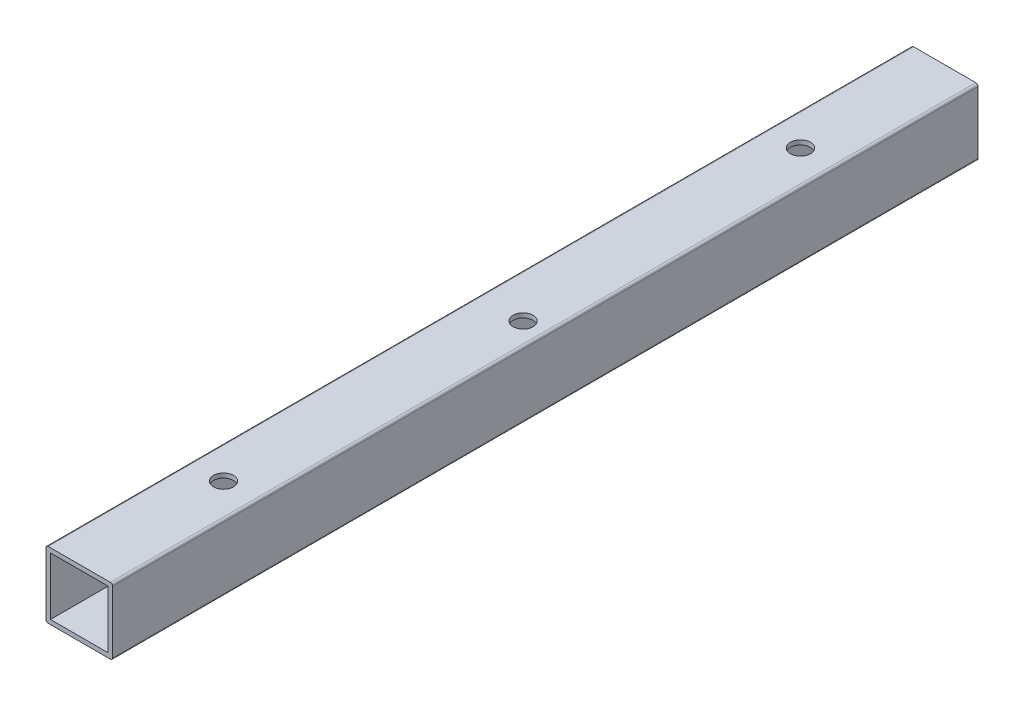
from build123d import *

# Parameters (mm, degrees)
ESQUISSE1_W             = 26
ESQUISSE1_H             = 26
BASE_EXTRU_MINCE_DEPTH  = 390
ESQUISSE2_R             = 4.5
ENL_V_MAT_EXTRU_1_DEPTH = 35


with BuildPart() as part:
    # Esquisse1 → Base-Extru.-Mince (new body)
    with BuildSketch(Plane.XY):
        with BuildLine():
            Line((14, -15), (-14, -15))
            ThreePointArc((-14, -15), (-14.707106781, -14.707106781), (-15, -14))
            Line((-15, -14), (-15, 14))
            ThreePointArc((-15, 14), (-14.707106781, 14.707106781), (-14, 15))
            Line((-14, 15), (14, 15))
            ThreePointArc((14, 15), (14.707106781, 14.707106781), (15, 14))
            Line((15, 14), (15, -14))
            ThreePointArc((15, -14), (14.707106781, -14.707106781), (14, -15))
        make_face()
        Rectangle(ESQUISSE1_W, ESQUISSE1_H, mode=Mode.SUBTRACT)
    extrude(amount=BASE_EXTRU_MINCE_DEPTH)

    # Esquisse2 → Enl_v. mat.-Extru.1 (cut)
    with BuildSketch(Plane.XZ.offset(15)):
        with Locations(Location((0, 325, 0), (0, 0, 90))):
            Circle(ESQUISSE2_R)
        with Locations(Location((0, 65, 0), (0, 0, 90))):
            Circle(ESQUISSE2_R)
        with Locations(Location((5, 195, 0), (0, 0, 90))):
            Circle(ESQUISSE2_R)
    extrude(amount=-ENL_V_MAT_EXTRU_1_DEPTH, mode=Mode.SUBTRACT)


solid = part.part
